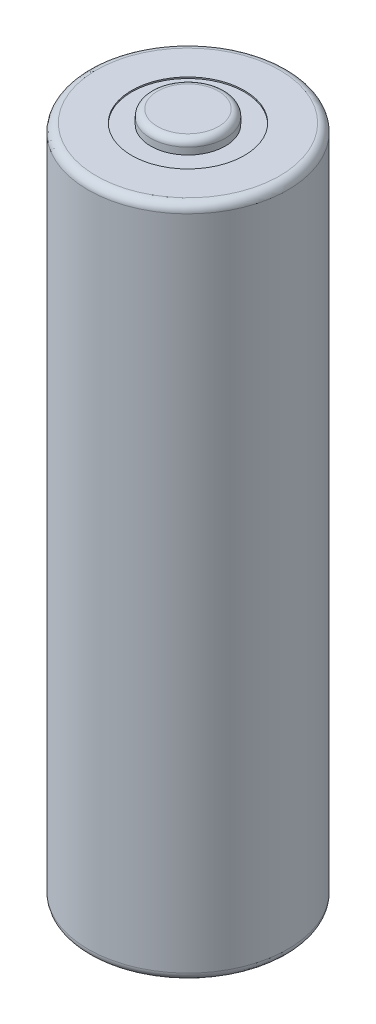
ISO-10303-21;
HEADER;
FILE_DESCRIPTION(('STEP AP214'),'2;1');
FILE_NAME('part.step','',(''),(''),'','','');
FILE_SCHEMA(('AUTOMOTIVE_DESIGN { 1 0 10303 214 1 1 1 1 }'));
ENDSEC;
DATA;
#1=APPLICATION_CONTEXT('core data for automotive mechanical design processes');
#2=APPLICATION_PROTOCOL_DEFINITION('international standard','automotive_design',2000,#1);
#3=PRODUCT_CONTEXT('',#1,'mechanical');
#4=PRODUCT('Part','Part','',(#3));
#5=PRODUCT_RELATED_PRODUCT_CATEGORY('part','',(#4));
#6=PRODUCT_DEFINITION_FORMATION('','',#4);
#7=PRODUCT_DEFINITION_CONTEXT('part definition',#1,'design');
#8=PRODUCT_DEFINITION('design','',#6,#7);
#9=PRODUCT_DEFINITION_SHAPE('','',#8);
#10=(LENGTH_UNIT() NAMED_UNIT(*) SI_UNIT(.MILLI.,.METRE.));
#11=(NAMED_UNIT(*) PLANE_ANGLE_UNIT() SI_UNIT($,.RADIAN.));
#12=(NAMED_UNIT(*) SI_UNIT($,.STERADIAN.) SOLID_ANGLE_UNIT());
#13=UNCERTAINTY_MEASURE_WITH_UNIT(LENGTH_MEASURE(1.E-05),#10,'distance_accuracy_value','');
#14=(GEOMETRIC_REPRESENTATION_CONTEXT(3) GLOBAL_UNCERTAINTY_ASSIGNED_CONTEXT((#13)) GLOBAL_UNIT_ASSIGNED_CONTEXT((#10,
#11,#12)) REPRESENTATION_CONTEXT('',''));
#15=CARTESIAN_POINT('',(0.,0.,0.));
#16=DIRECTION('',(0.,0.,1.));
#17=DIRECTION('',(1.,0.,0.));
#18=AXIS2_PLACEMENT_3D('',#15,#16,#17);
#19=CARTESIAN_POINT('',(0.,50.5,0.));
#20=DIRECTION('',(0.,1.,0.));
#21=DIRECTION('',(0.,0.,1.));
#22=AXIS2_PLACEMENT_3D('',#19,#20,#21);
#23=PLANE('',#22);
#24=CARTESIAN_POINT('',(0.,50.5,0.));
#25=DIRECTION('',(0.,1.,0.));
#26=DIRECTION('',(0.,0.,1.));
#27=AXIS2_PLACEMENT_3D('',#24,#25,#26);
#28=CIRCLE('',#27,2.25);
#29=CARTESIAN_POINT('',(0.,50.5,2.25));
#30=VERTEX_POINT('',#29);
#31=EDGE_CURVE('E43',#30,#30,#28,.T.);
#32=ORIENTED_EDGE('',*,*,#31,.T.);
#33=EDGE_LOOP('',(#32));
#34=FACE_BOUND('',#33,.T.);
#35=ADVANCED_FACE('F31',(#34),#23,.T.);
#36=CARTESIAN_POINT('',(0.,0.,0.));
#37=DIRECTION('',(0.,-1.,0.));
#38=DIRECTION('',(0.,0.,-1.));
#39=AXIS2_PLACEMENT_3D('',#36,#37,#38);
#40=CYLINDRICAL_SURFACE('',#39,2.75);
#41=CARTESIAN_POINT('',(0.,50.,0.));
#42=DIRECTION('',(0.,1.,0.));
#43=DIRECTION('',(0.,0.,1.));
#44=AXIS2_PLACEMENT_3D('',#41,#42,#43);
#45=CIRCLE('',#44,2.75);
#46=CARTESIAN_POINT('',(0.,50.,2.75));
#47=VERTEX_POINT('',#46);
#48=EDGE_CURVE('E57',#47,#47,#45,.F.);
#49=ORIENTED_EDGE('',*,*,#48,.T.);
#50=EDGE_LOOP('',(#49));
#51=FACE_BOUND('',#50,.T.);
#52=CARTESIAN_POINT('',(0.,49.5,0.));
#53=DIRECTION('',(0.,-1.,0.));
#54=DIRECTION('',(0.,0.,-1.));
#55=AXIS2_PLACEMENT_3D('',#52,#53,#54);
#56=CIRCLE('',#55,2.75);
#57=CARTESIAN_POINT('',(0.,49.5,-2.75));
#58=VERTEX_POINT('',#57);
#59=EDGE_CURVE('E54',#58,#58,#56,.T.);
#60=ORIENTED_EDGE('',*,*,#59,.F.);
#61=EDGE_LOOP('',(#60));
#62=FACE_BOUND('',#61,.T.);
#63=ADVANCED_FACE('F69',(#51,#62),#40,.T.);
#64=CARTESIAN_POINT('',(2.75,49.5,0.));
#65=DIRECTION('',(0.,1.,0.));
#66=DIRECTION('',(0.,0.,1.));
#67=AXIS2_PLACEMENT_3D('',#64,#65,#66);
#68=PLANE('',#67);
#69=CARTESIAN_POINT('',(0.,49.5,0.));
#70=DIRECTION('',(0.,1.,0.));
#71=DIRECTION('',(0.,0.,1.));
#72=AXIS2_PLACEMENT_3D('',#69,#70,#71);
#73=CIRCLE('',#72,4.15);
#74=CARTESIAN_POINT('',(0.,49.5,4.15));
#75=VERTEX_POINT('',#74);
#76=EDGE_CURVE('E10',#75,#75,#73,.F.);
#77=ORIENTED_EDGE('',*,*,#76,.F.);
#78=EDGE_LOOP('',(#77));
#79=FACE_BOUND('',#78,.T.);
#80=ORIENTED_EDGE('',*,*,#59,.T.);
#81=EDGE_LOOP('',(#80));
#82=FACE_BOUND('',#81,.T.);
#83=ADVANCED_FACE('F66',(#79,#82),#68,.T.);
#84=CARTESIAN_POINT('',(0.,50.,0.));
#85=DIRECTION('',(0.,1.,0.));
#86=DIRECTION('',(0.,0.,1.));
#87=AXIS2_PLACEMENT_3D('',#84,#85,#86);
#88=TOROIDAL_SURFACE('',#87,2.25,0.5);
#89=ORIENTED_EDGE('',*,*,#31,.F.);
#90=EDGE_LOOP('',(#89));
#91=FACE_BOUND('',#90,.T.);
#92=ORIENTED_EDGE('',*,*,#48,.F.);
#93=EDGE_LOOP('',(#92));
#94=FACE_BOUND('',#93,.T.);
#95=ADVANCED_FACE('F33',(#91,#94),#88,.T.);
#96=CARTESIAN_POINT('',(0.,0.,0.));
#97=DIRECTION('',(0.,-1.,0.));
#98=DIRECTION('',(0.,0.,-1.));
#99=AXIS2_PLACEMENT_3D('',#96,#97,#98);
#100=CYLINDRICAL_SURFACE('',#99,4.15);
#101=ORIENTED_EDGE('',*,*,#76,.T.);
#102=EDGE_LOOP('',(#101));
#103=FACE_BOUND('',#102,.T.);
#104=CARTESIAN_POINT('',(0.,49.6,0.));
#105=DIRECTION('',(0.,-1.,0.));
#106=DIRECTION('',(0.,0.,-1.));
#107=AXIS2_PLACEMENT_3D('',#104,#105,#106);
#108=CIRCLE('',#107,4.15);
#109=CARTESIAN_POINT('',(0.,49.6,-4.15));
#110=VERTEX_POINT('',#109);
#111=EDGE_CURVE('E198',#110,#110,#108,.T.);
#112=ORIENTED_EDGE('',*,*,#111,.F.);
#113=EDGE_LOOP('',(#112));
#114=FACE_BOUND('',#113,.T.);
#115=ADVANCED_FACE('F65',(#103,#114),#100,.F.);
#116=CARTESIAN_POINT('',(0.,49.,0.));
#117=DIRECTION('',(0.,-1.,0.));
#118=DIRECTION('',(0.,0.,-1.));
#119=AXIS2_PLACEMENT_3D('',#116,#117,#118);
#120=TOROIDAL_SURFACE('',#119,6.75,0.600000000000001);
#121=CARTESIAN_POINT('',(0.,49.6,0.));
#122=DIRECTION('',(0.,-1.,0.));
#123=DIRECTION('',(0.,0.,-1.));
#124=AXIS2_PLACEMENT_3D('',#121,#122,#123);
#125=CIRCLE('',#124,6.75);
#126=CARTESIAN_POINT('',(0.,49.6,-6.75));
#127=VERTEX_POINT('',#126);
#128=EDGE_CURVE('E46',#127,#127,#125,.T.);
#129=ORIENTED_EDGE('',*,*,#128,.T.);
#130=EDGE_LOOP('',(#129));
#131=FACE_BOUND('',#130,.T.);
#132=CARTESIAN_POINT('',(0.,49.,0.));
#133=DIRECTION('',(0.,-1.,0.));
#134=DIRECTION('',(0.,0.,-1.));
#135=AXIS2_PLACEMENT_3D('',#132,#133,#134);
#136=CIRCLE('',#135,7.35);
#137=CARTESIAN_POINT('',(0.,49.,-7.35));
#138=VERTEX_POINT('',#137);
#139=EDGE_CURVE('E208',#138,#138,#136,.T.);
#140=ORIENTED_EDGE('',*,*,#139,.F.);
#141=EDGE_LOOP('',(#140));
#142=FACE_BOUND('',#141,.T.);
#143=ADVANCED_FACE('F109',(#131,#142),#120,.T.);
#144=CARTESIAN_POINT('',(6.75,49.6,0.));
#145=DIRECTION('',(0.,1.,0.));
#146=DIRECTION('',(0.,0.,1.));
#147=AXIS2_PLACEMENT_3D('',#144,#145,#146);
#148=PLANE('',#147);
#149=ORIENTED_EDGE('',*,*,#111,.T.);
#150=EDGE_LOOP('',(#149));
#151=FACE_BOUND('',#150,.T.);
#152=ORIENTED_EDGE('',*,*,#128,.F.);
#153=EDGE_LOOP('',(#152));
#154=FACE_BOUND('',#153,.T.);
#155=ADVANCED_FACE('F116',(#151,#154),#148,.T.);
#156=CARTESIAN_POINT('',(0.,0.1,0.));
#157=DIRECTION('',(0.,-1.,0.));
#158=DIRECTION('',(0.,0.,-1.));
#159=AXIS2_PLACEMENT_3D('',#156,#157,#158);
#160=CIRCLE('',#159,4.15);
#161=CARTESIAN_POINT('',(0.,0.1,-4.15));
#162=VERTEX_POINT('',#161);
#163=EDGE_CURVE('E35',#162,#162,#160,.F.);
#164=ORIENTED_EDGE('',*,*,#163,.T.);
#165=EDGE_LOOP('',(#164));
#166=FACE_BOUND('',#165,.T.);
#167=CARTESIAN_POINT('',(0.,0.,0.));
#168=DIRECTION('',(0.,-1.,0.));
#169=DIRECTION('',(0.,0.,-1.));
#170=AXIS2_PLACEMENT_3D('',#167,#168,#169);
#171=CIRCLE('',#170,4.15);
#172=CARTESIAN_POINT('',(0.,0.,-4.15));
#173=VERTEX_POINT('',#172);
#174=EDGE_CURVE('E196',#173,#173,#171,.T.);
#175=ORIENTED_EDGE('',*,*,#174,.T.);
#176=EDGE_LOOP('',(#175));
#177=FACE_BOUND('',#176,.T.);
#178=ADVANCED_FACE('F111',(#166,#177),#100,.F.);
#179=CARTESIAN_POINT('',(6.75,0.,0.));
#180=DIRECTION('',(0.,-1.,0.));
#181=DIRECTION('',(0.,0.,-1.));
#182=AXIS2_PLACEMENT_3D('',#179,#180,#181);
#183=PLANE('',#182);
#184=CARTESIAN_POINT('',(0.,0.,0.));
#185=DIRECTION('',(0.,-1.,0.));
#186=DIRECTION('',(0.,0.,-1.));
#187=AXIS2_PLACEMENT_3D('',#184,#185,#186);
#188=CIRCLE('',#187,6.75);
#189=CARTESIAN_POINT('',(0.,0.,-6.75));
#190=VERTEX_POINT('',#189);
#191=EDGE_CURVE('E199',#190,#190,#188,.T.);
#192=ORIENTED_EDGE('',*,*,#191,.T.);
#193=EDGE_LOOP('',(#192));
#194=FACE_BOUND('',#193,.T.);
#195=ORIENTED_EDGE('',*,*,#174,.F.);
#196=EDGE_LOOP('',(#195));
#197=FACE_BOUND('',#196,.T.);
#198=ADVANCED_FACE('F131',(#194,#197),#183,.T.);
#199=CARTESIAN_POINT('',(0.,0.600000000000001,0.));
#200=DIRECTION('',(0.,-1.,0.));
#201=DIRECTION('',(0.,0.,-1.));
#202=AXIS2_PLACEMENT_3D('',#199,#200,#201);
#203=TOROIDAL_SURFACE('',#202,6.75,0.6);
#204=CARTESIAN_POINT('',(0.,0.600000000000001,0.));
#205=DIRECTION('',(0.,-1.,0.));
#206=DIRECTION('',(0.,0.,-1.));
#207=AXIS2_PLACEMENT_3D('',#204,#205,#206);
#208=CIRCLE('',#207,7.35);
#209=CARTESIAN_POINT('',(0.,0.600000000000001,-7.35));
#210=VERTEX_POINT('',#209);
#211=EDGE_CURVE('E203',#210,#210,#208,.T.);
#212=ORIENTED_EDGE('',*,*,#211,.T.);
#213=EDGE_LOOP('',(#212));
#214=FACE_BOUND('',#213,.T.);
#215=ORIENTED_EDGE('',*,*,#191,.F.);
#216=EDGE_LOOP('',(#215));
#217=FACE_BOUND('',#216,.T.);
#218=ADVANCED_FACE('F138',(#214,#217),#203,.T.);
#219=CARTESIAN_POINT('',(0.,0.,0.));
#220=DIRECTION('',(0.,-1.,0.));
#221=DIRECTION('',(0.,0.,-1.));
#222=AXIS2_PLACEMENT_3D('',#219,#220,#221);
#223=CYLINDRICAL_SURFACE('',#222,7.35);
#224=ORIENTED_EDGE('',*,*,#139,.T.);
#225=EDGE_LOOP('',(#224));
#226=FACE_BOUND('',#225,.T.);
#227=ORIENTED_EDGE('',*,*,#211,.F.);
#228=EDGE_LOOP('',(#227));
#229=FACE_BOUND('',#228,.T.);
#230=ADVANCED_FACE('F146',(#226,#229),#223,.T.);
#231=CARTESIAN_POINT('',(2.5,0.,0.));
#232=DIRECTION('',(0.,-1.,0.));
#233=DIRECTION('',(0.,0.,-1.));
#234=AXIS2_PLACEMENT_3D('',#231,#232,#233);
#235=PLANE('',#234);
#236=CARTESIAN_POINT('',(0.,0.,0.));
#237=DIRECTION('',(0.,-1.,0.));
#238=DIRECTION('',(0.,0.,-1.));
#239=AXIS2_PLACEMENT_3D('',#236,#237,#238);
#240=CIRCLE('',#239,2.5);
#241=CARTESIAN_POINT('',(0.,0.,-2.5));
#242=VERTEX_POINT('',#241);
#243=EDGE_CURVE('E48',#242,#242,#240,.T.);
#244=ORIENTED_EDGE('',*,*,#243,.T.);
#245=EDGE_LOOP('',(#244));
#246=FACE_BOUND('',#245,.T.);
#247=ADVANCED_FACE('F90',(#246),#235,.T.);
#248=CARTESIAN_POINT('',(0.,0.,0.));
#249=DIRECTION('',(0.,1.,0.));
#250=DIRECTION('',(0.,0.,1.));
#251=AXIS2_PLACEMENT_3D('',#248,#249,#250);
#252=CONICAL_SURFACE('',#251,2.5,1.47112767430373);
#253=CARTESIAN_POINT('',(0.,0.1,0.));
#254=DIRECTION('',(0.,-1.,0.));
#255=DIRECTION('',(0.,0.,-1.));
#256=AXIS2_PLACEMENT_3D('',#253,#254,#255);
#257=CIRCLE('',#256,3.5);
#258=CARTESIAN_POINT('',(0.,0.1,-3.5));
#259=VERTEX_POINT('',#258);
#260=EDGE_CURVE('E51',#259,#259,#257,.T.);
#261=ORIENTED_EDGE('',*,*,#260,.T.);
#262=EDGE_LOOP('',(#261));
#263=FACE_BOUND('',#262,.T.);
#264=ORIENTED_EDGE('',*,*,#243,.F.);
#265=EDGE_LOOP('',(#264));
#266=FACE_BOUND('',#265,.T.);
#267=ADVANCED_FACE('F163',(#263,#266),#252,.T.);
#268=CARTESIAN_POINT('',(7.25000000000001,0.1,0.));
#269=DIRECTION('',(0.,-1.,0.));
#270=DIRECTION('',(0.,0.,-1.));
#271=AXIS2_PLACEMENT_3D('',#268,#269,#270);
#272=PLANE('',#271);
#273=ORIENTED_EDGE('',*,*,#163,.F.);
#274=EDGE_LOOP('',(#273));
#275=FACE_BOUND('',#274,.T.);
#276=ORIENTED_EDGE('',*,*,#260,.F.);
#277=EDGE_LOOP('',(#276));
#278=FACE_BOUND('',#277,.T.);
#279=ADVANCED_FACE('F160',(#275,#278),#272,.T.);
#280=CLOSED_SHELL('',(#35,#63,#83,#95,#115,#143,#155,#178,#198,#218,#230,#247,#267,#279));
#281=MANIFOLD_SOLID_BREP('B2',#280);
#282=ADVANCED_BREP_SHAPE_REPRESENTATION('',(#18,#281),#14);
#283=SHAPE_DEFINITION_REPRESENTATION(#9,#282);
ENDSEC;
END-ISO-10303-21;
